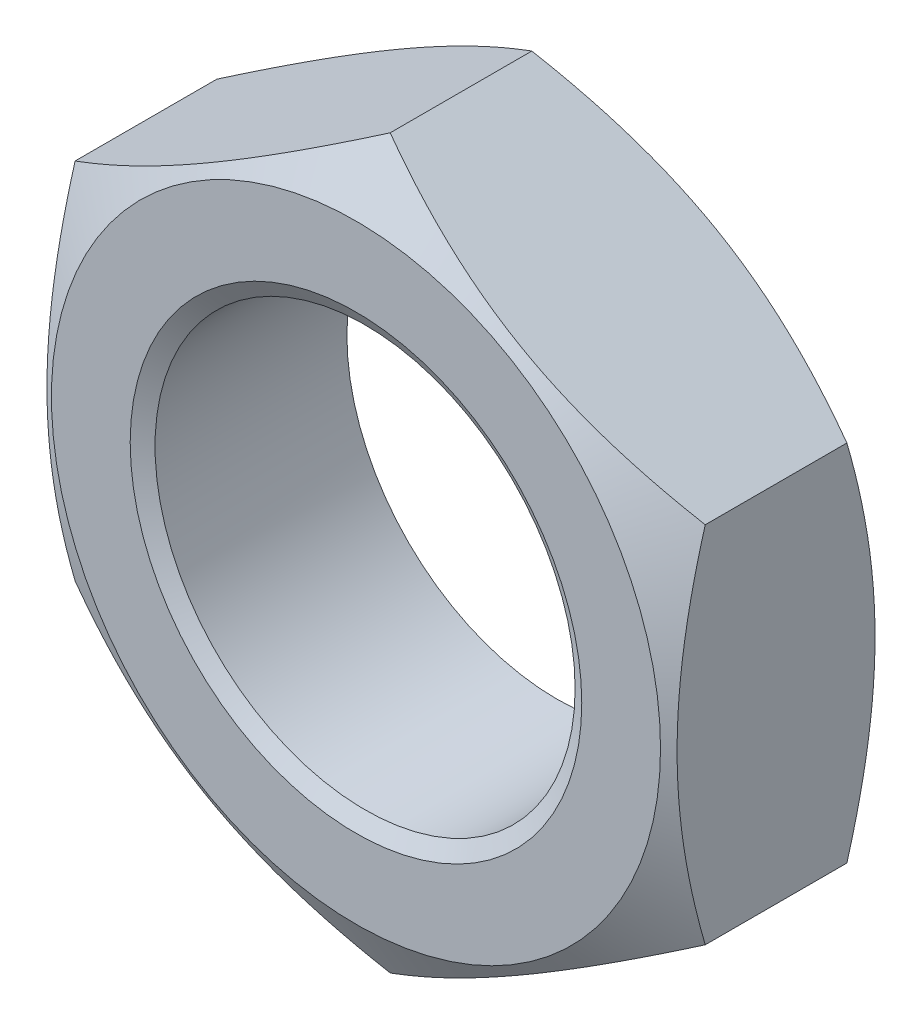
ISO-10303-21;
HEADER;
FILE_DESCRIPTION(('STEP AP214'),'2;1');
FILE_NAME('part.step','',(''),(''),'','','');
FILE_SCHEMA(('AUTOMOTIVE_DESIGN { 1 0 10303 214 1 1 1 1 }'));
ENDSEC;
DATA;
#1=APPLICATION_CONTEXT('core data for automotive mechanical design processes');
#2=APPLICATION_PROTOCOL_DEFINITION('international standard','automotive_design',2000,#1);
#3=PRODUCT_CONTEXT('',#1,'mechanical');
#4=PRODUCT('Part','Part','',(#3));
#5=PRODUCT_RELATED_PRODUCT_CATEGORY('part','',(#4));
#6=PRODUCT_DEFINITION_FORMATION('','',#4);
#7=PRODUCT_DEFINITION_CONTEXT('part definition',#1,'design');
#8=PRODUCT_DEFINITION('design','',#6,#7);
#9=PRODUCT_DEFINITION_SHAPE('','',#8);
#10=(LENGTH_UNIT() NAMED_UNIT(*) SI_UNIT(.MILLI.,.METRE.));
#11=(NAMED_UNIT(*) PLANE_ANGLE_UNIT() SI_UNIT($,.RADIAN.));
#12=(NAMED_UNIT(*) SI_UNIT($,.STERADIAN.) SOLID_ANGLE_UNIT());
#13=UNCERTAINTY_MEASURE_WITH_UNIT(LENGTH_MEASURE(1.E-05),#10,'distance_accuracy_value','');
#14=(GEOMETRIC_REPRESENTATION_CONTEXT(3) GLOBAL_UNCERTAINTY_ASSIGNED_CONTEXT((#13)) GLOBAL_UNIT_ASSIGNED_CONTEXT((#10,
#11,#12)) REPRESENTATION_CONTEXT('',''));
#15=CARTESIAN_POINT('',(0.,0.,0.));
#16=DIRECTION('',(0.,0.,1.));
#17=DIRECTION('',(1.,0.,0.));
#18=AXIS2_PLACEMENT_3D('',#15,#16,#17);
#19=CARTESIAN_POINT('',(0.,17.3205080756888,10.));
#20=DIRECTION('',(0.,0.,1.));
#21=DIRECTION('',(1.,0.,0.));
#22=AXIS2_PLACEMENT_3D('',#19,#20,#21);
#23=PLANE('',#22);
#24=CARTESIAN_POINT('',(0.,0.,10.));
#25=DIRECTION('',(0.,0.,1.));
#26=DIRECTION('',(1.,0.,0.));
#27=AXIS2_PLACEMENT_3D('',#24,#25,#26);
#28=CIRCLE('',#27,14.5);
#29=CARTESIAN_POINT('',(14.5,0.,10.));
#30=VERTEX_POINT('',#29);
#31=EDGE_CURVE('E115',#30,#30,#28,.T.);
#32=ORIENTED_EDGE('',*,*,#31,.T.);
#33=EDGE_LOOP('',(#32));
#34=FACE_BOUND('',#33,.T.);
#35=CARTESIAN_POINT('',(0.,0.,10.));
#36=DIRECTION('',(0.,0.,-1.));
#37=DIRECTION('',(-1.,0.,0.));
#38=AXIS2_PLACEMENT_3D('',#35,#36,#37);
#39=CIRCLE('',#38,10.75);
#40=CARTESIAN_POINT('',(-10.75,0.,10.));
#41=VERTEX_POINT('',#40);
#42=EDGE_CURVE('E327',#41,#41,#39,.T.);
#43=ORIENTED_EDGE('',*,*,#42,.T.);
#44=EDGE_LOOP('',(#43));
#45=FACE_BOUND('',#44,.T.);
#46=ADVANCED_FACE('F14',(#34,#45),#23,.T.);
#47=CARTESIAN_POINT('',(15.,8.66025403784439,10.));
#48=DIRECTION('',(-0.5,-0.866025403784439,0.));
#49=DIRECTION('',(0.866025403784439,-0.5,0.));
#50=AXIS2_PLACEMENT_3D('',#47,#48,#49);
#51=PLANE('',#50);
#52=CARTESIAN_POINT('',(-2.01686435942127,18.4849452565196,2.36404626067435));
#53=CARTESIAN_POINT('',(-1.64806315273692,18.2720177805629,2.21877729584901));
#54=CARTESIAN_POINT('',(-1.27778435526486,18.0582372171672,2.07835415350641));
#55=CARTESIAN_POINT('',(-0.533973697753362,17.6287979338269,1.80894242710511));
#56=CARTESIAN_POINT('',(-0.160440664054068,17.4131385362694,1.67995817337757));
#57=CARTESIAN_POINT('',(0.591460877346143,16.9790279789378,1.43476990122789));
#58=CARTESIAN_POINT('',(0.969843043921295,16.7605689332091,1.31862134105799));
#59=CARTESIAN_POINT('',(1.72989706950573,16.3217515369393,1.10180197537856));
#60=CARTESIAN_POINT('',(2.11156857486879,16.1013933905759,1.00112952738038));
#61=CARTESIAN_POINT('',(2.86621796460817,15.6656963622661,0.820250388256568));
#62=CARTESIAN_POINT('',(3.23909854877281,15.4504136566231,0.73950598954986));
#63=CARTESIAN_POINT('',(3.98753422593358,15.0183041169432,0.596486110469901));
#64=CARTESIAN_POINT('',(4.36308935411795,14.8014772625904,0.534210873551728));
#65=CARTESIAN_POINT('',(5.11559143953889,14.3670199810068,0.429942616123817));
#66=CARTESIAN_POINT('',(5.49253433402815,14.1493918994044,0.387910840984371));
#67=CARTESIAN_POINT('',(6.24775454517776,13.7133653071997,0.325235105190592));
#68=CARTESIAN_POINT('',(6.62603181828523,13.4949668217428,0.304590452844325));
#69=CARTESIAN_POINT('',(7.36041204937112,13.0709721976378,0.285928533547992));
#70=CARTESIAN_POINT('',(7.7164908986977,12.8653899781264,0.286634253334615));
#71=CARTESIAN_POINT('',(8.42821777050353,12.4544742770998,0.307519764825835));
#72=CARTESIAN_POINT('',(8.78386579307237,12.2491407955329,0.327699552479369));
#73=CARTESIAN_POINT('',(9.49454258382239,11.8388313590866,0.387002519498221));
#74=CARTESIAN_POINT('',(9.84956942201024,11.6338565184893,0.426156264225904));
#75=CARTESIAN_POINT('',(10.5577808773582,11.224970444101,0.522359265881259));
#76=CARTESIAN_POINT('',(10.9109655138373,11.0210591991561,0.57940833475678));
#77=CARTESIAN_POINT('',(11.6254284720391,10.6085638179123,0.711933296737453));
#78=CARTESIAN_POINT('',(11.9866375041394,10.4000196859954,0.787903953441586));
#79=CARTESIAN_POINT('',(12.7063665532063,9.98448392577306,0.955622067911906));
#80=CARTESIAN_POINT('',(13.064885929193,9.77749266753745,1.04737316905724));
#81=CARTESIAN_POINT('',(13.7779053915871,9.36583068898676,1.24454431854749));
#82=CARTESIAN_POINT('',(14.1324144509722,9.16115478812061,1.34992143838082));
#83=CARTESIAN_POINT('',(14.838373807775,8.75356896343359,1.57282949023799));
#84=CARTESIAN_POINT('',(15.1898255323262,8.5506582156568,1.6903543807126));
#85=CARTESIAN_POINT('',(15.5398459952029,8.34857380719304,1.81314001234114));
#86=B_SPLINE_CURVE_WITH_KNOTS('',3,(#52,#53,#54,#55,#56,#57,#58,#59,#60,#61,#62,#63,#64,#65,#66,
#67,#68,#69,#70,#71,#72,#73,#74,#75,#76,#77,#78,#79,#80,#81,#82,#83,#84,#85),.UNSPECIFIED.,.F.,
.F.,(4,2,2,2,2,2,2,2,2,2,2,2,2,2,2,2,4),(0.,1.34989753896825,2.70030393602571,4.05633390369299,
5.41221985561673,6.72607188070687,8.03994122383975,9.35128516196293,10.6625866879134,
11.8956205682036,13.1286541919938,14.3636807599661,15.5986943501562,16.8702080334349,
18.1420156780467,19.4099099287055,20.6771766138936),.UNSPECIFIED.);
#87=CARTESIAN_POINT('',(0.,17.3205080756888,1.62842109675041));
#88=VERTEX_POINT('',#87);
#89=CARTESIAN_POINT('',(15.,8.66025403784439,1.62842109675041));
#90=VERTEX_POINT('',#89);
#91=EDGE_CURVE('E31',#88,#90,#86,.T.);
#92=ORIENTED_EDGE('',*,*,#91,.F.);
#93=DIRECTION('',(0.,0.,-1.));
#94=VECTOR('',#93,1.);
#95=CARTESIAN_POINT('',(0.,17.3205080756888,10.));
#96=LINE('',#95,#94);
#97=CARTESIAN_POINT('',(0.,17.3205080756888,8.37157890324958));
#98=VERTEX_POINT('',#97);
#99=EDGE_CURVE('E9',#98,#88,#96,.T.);
#100=ORIENTED_EDGE('',*,*,#99,.F.);
#101=CARTESIAN_POINT('',(15.5398459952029,8.34857380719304,8.18685998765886));
#102=CARTESIAN_POINT('',(15.1898255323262,8.5506582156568,8.30964561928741));
#103=CARTESIAN_POINT('',(14.838373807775,8.75356896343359,8.42717050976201));
#104=CARTESIAN_POINT('',(14.1324144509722,9.16115478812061,8.65007856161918));
#105=CARTESIAN_POINT('',(13.7779053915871,9.36583068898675,8.75545568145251));
#106=CARTESIAN_POINT('',(13.064885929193,9.77749266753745,8.95262683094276));
#107=CARTESIAN_POINT('',(12.7063665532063,9.98448392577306,9.04437793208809));
#108=CARTESIAN_POINT('',(11.9866375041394,10.4000196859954,9.21209604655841));
#109=CARTESIAN_POINT('',(11.6254284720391,10.6085638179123,9.28806670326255));
#110=CARTESIAN_POINT('',(10.9109655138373,11.0210591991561,9.42059166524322));
#111=CARTESIAN_POINT('',(10.5577808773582,11.224970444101,9.47764073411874));
#112=CARTESIAN_POINT('',(9.84956942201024,11.6338565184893,9.57384373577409));
#113=CARTESIAN_POINT('',(9.49454258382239,11.8388313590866,9.61299748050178));
#114=CARTESIAN_POINT('',(8.78386579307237,12.2491407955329,9.67230044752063));
#115=CARTESIAN_POINT('',(8.42821777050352,12.4544742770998,9.69248023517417));
#116=CARTESIAN_POINT('',(7.7164908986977,12.8653899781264,9.71336574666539));
#117=CARTESIAN_POINT('',(7.36041204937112,13.0709721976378,9.714071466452));
#118=CARTESIAN_POINT('',(6.62603181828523,13.4949668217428,9.69540954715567));
#119=CARTESIAN_POINT('',(6.24775454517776,13.7133653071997,9.67476489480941));
#120=CARTESIAN_POINT('',(5.49253433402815,14.1493918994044,9.61208915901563));
#121=CARTESIAN_POINT('',(5.11559143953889,14.3670199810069,9.57005738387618));
#122=CARTESIAN_POINT('',(4.36308935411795,14.8014772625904,9.46578912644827));
#123=CARTESIAN_POINT('',(3.98753422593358,15.0183041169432,9.4035138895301));
#124=CARTESIAN_POINT('',(3.23909854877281,15.4504136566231,9.26049401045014));
#125=CARTESIAN_POINT('',(2.86621796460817,15.6656963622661,9.17974961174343));
#126=CARTESIAN_POINT('',(2.11156857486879,16.1013933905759,8.99887047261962));
#127=CARTESIAN_POINT('',(1.72989706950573,16.3217515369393,8.89819802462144));
#128=CARTESIAN_POINT('',(0.969843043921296,16.7605689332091,8.68137865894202));
#129=CARTESIAN_POINT('',(0.591460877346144,16.9790279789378,8.56523009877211));
#130=CARTESIAN_POINT('',(-0.160440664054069,17.4131385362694,8.32004182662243));
#131=CARTESIAN_POINT('',(-0.533973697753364,17.6287979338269,8.19105757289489));
#132=CARTESIAN_POINT('',(-1.27778435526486,18.0582372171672,7.92164584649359));
#133=CARTESIAN_POINT('',(-1.64806315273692,18.2720177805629,7.78122270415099));
#134=CARTESIAN_POINT('',(-2.01686435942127,18.4849452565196,7.63595373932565));
#135=B_SPLINE_CURVE_WITH_KNOTS('',3,(#101,#102,#103,#104,#105,#106,#107,#108,#109,#110,#111,
#112,#113,#114,#115,#116,#117,#118,#119,#120,#121,#122,#123,#124,#125,#126,#127,#128,#129,#130,
#131,#132,#133,#134),.UNSPECIFIED.,.F.,.F.,(4,2,2,2,2,2,2,2,2,2,2,2,2,2,2,2,4),(0.,
1.26726668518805,2.53516093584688,3.80696858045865,5.07848226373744,6.31349585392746,
7.5485224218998,8.78155604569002,10.0145899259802,11.3258914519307,12.6372353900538,
13.9511047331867,15.2649567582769,16.6208427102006,17.9768726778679,19.3272790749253,
20.6771766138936),.UNSPECIFIED.);
#136=CARTESIAN_POINT('',(15.,8.66025403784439,8.37157890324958));
#137=VERTEX_POINT('',#136);
#138=EDGE_CURVE('E92',#137,#98,#135,.T.);
#139=ORIENTED_EDGE('',*,*,#138,.F.);
#140=DIRECTION('',(0.,0.,-1.));
#141=VECTOR('',#140,1.);
#142=CARTESIAN_POINT('',(15.,8.66025403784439,10.));
#143=LINE('',#142,#141);
#144=EDGE_CURVE('E88',#137,#90,#143,.T.);
#145=ORIENTED_EDGE('',*,*,#144,.T.);
#146=EDGE_LOOP('',(#92,#100,#139,#145));
#147=FACE_BOUND('',#146,.T.);
#148=ADVANCED_FACE('F16',(#147),#51,.F.);
#149=CARTESIAN_POINT('',(0.,17.3205080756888,10.));
#150=DIRECTION('',(0.5,-0.866025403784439,0.));
#151=DIRECTION('',(0.866025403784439,0.5,0.));
#152=AXIS2_PLACEMENT_3D('',#149,#150,#151);
#153=PLANE('',#152);
#154=CARTESIAN_POINT('',(-27.9567259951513,1.17968479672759,7.78360792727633));
#155=CARTESIAN_POINT('',(-27.6585449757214,1.35183968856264,7.61580014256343));
#156=CARTESIAN_POINT('',(-27.3600071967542,1.52420055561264,7.44883798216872));
#157=CARTESIAN_POINT('',(-26.7621396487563,1.86937954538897,7.11680576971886));
#158=CARTESIAN_POINT('',(-26.4628098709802,2.04219767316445,6.95173573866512));
#159=CARTESIAN_POINT('',(-25.5634217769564,2.56145963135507,6.45961434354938));
#160=CARTESIAN_POINT('',(-24.9620670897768,2.90865192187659,6.13570946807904));
#161=CARTESIAN_POINT('',(-23.7513280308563,3.60767244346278,5.49634103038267));
#162=CARTESIAN_POINT('',(-23.1419168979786,3.95951612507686,5.1809448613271));
#163=CARTESIAN_POINT('',(-21.9180176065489,4.66613471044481,4.56362750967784));
#164=CARTESIAN_POINT('',(-21.3035297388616,5.02090944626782,4.26170556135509));
#165=CARTESIAN_POINT('',(-20.0606068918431,5.73851128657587,3.67142004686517));
#166=CARTESIAN_POINT('',(-19.4320937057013,6.1013835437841,3.38327484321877));
#167=CARTESIAN_POINT('',(-18.1673821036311,6.83156512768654,2.8299153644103));
#168=CARTESIAN_POINT('',(-17.5311826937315,7.1988750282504,2.56470409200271));
#169=CARTESIAN_POINT('',(-16.2514978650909,7.93770140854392,2.06490465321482));
#170=CARTESIAN_POINT('',(-15.6080343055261,8.30920526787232,1.8302425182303));
#171=CARTESIAN_POINT('',(-14.3114560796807,9.0577850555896,1.39981722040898));
#172=CARTESIAN_POINT('',(-13.6583450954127,9.43485885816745,1.20403960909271));
#173=CARTESIAN_POINT('',(-12.687282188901,9.99550228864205,0.951625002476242));
#174=CARTESIAN_POINT('',(-12.3730361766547,10.1769323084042,0.875834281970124));
#175=CARTESIAN_POINT('',(-11.7424785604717,10.540984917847,0.736662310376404));
#176=CARTESIAN_POINT('',(-11.4261670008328,10.7236074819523,0.673280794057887));
#177=CARTESIAN_POINT('',(-10.7916974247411,11.0899186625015,0.560059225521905));
#178=CARTESIAN_POINT('',(-10.4735392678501,11.2736073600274,0.51022021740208));
#179=CARTESIAN_POINT('',(-9.83575587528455,11.6418317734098,0.425091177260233));
#180=CARTESIAN_POINT('',(-9.51613063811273,11.8263674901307,0.389801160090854));
#181=CARTESIAN_POINT('',(-8.87796339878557,12.1948135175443,0.334723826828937));
#182=CARTESIAN_POINT('',(-8.55942786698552,12.3787200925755,0.314837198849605));
#183=CARTESIAN_POINT('',(-7.92191526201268,12.7467881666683,0.29064410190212));
#184=CARTESIAN_POINT('',(-7.60293819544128,12.9309496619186,0.286337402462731));
#185=CARTESIAN_POINT('',(-6.96519755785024,13.299149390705,0.293405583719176));
#186=CARTESIAN_POINT('',(-6.64643395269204,13.4831876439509,0.304776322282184));
#187=CARTESIAN_POINT('',(-6.0095976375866,13.8508652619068,0.342921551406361));
#188=CARTESIAN_POINT('',(-5.69152495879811,14.0345046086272,0.369696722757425));
#189=CARTESIAN_POINT('',(-4.91661491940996,14.4818991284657,0.453141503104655));
#190=CARTESIAN_POINT('',(-4.46040945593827,14.7452894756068,0.517785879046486));
#191=CARTESIAN_POINT('',(-3.55166052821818,15.2699559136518,0.675130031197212));
#192=CARTESIAN_POINT('',(-3.09911763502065,15.5312316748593,0.767834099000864));
#193=CARTESIAN_POINT('',(-1.74615244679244,16.312366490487,1.08337588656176));
#194=CARTESIAN_POINT('',(-0.852169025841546,16.8285080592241,1.34342798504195));
#195=CARTESIAN_POINT('',(0.485139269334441,17.6006033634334,1.79064006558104));
#196=CARTESIAN_POINT('',(0.935471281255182,17.8606026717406,1.95143407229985));
#197=CARTESIAN_POINT('',(1.83178276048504,18.3780883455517,2.28873818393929));
#198=CARTESIAN_POINT('',(2.27776183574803,18.6355744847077,2.46524969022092));
#199=CARTESIAN_POINT('',(3.16314256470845,19.1467492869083,2.83025115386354));
#200=CARTESIAN_POINT('',(3.60256718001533,19.4004512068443,3.01866746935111));
#201=CARTESIAN_POINT('',(4.25895131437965,19.7794147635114,3.30929326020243));
#202=CARTESIAN_POINT('',(4.47725234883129,19.9054509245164,3.40748564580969));
#203=CARTESIAN_POINT('',(4.91301153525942,20.1570366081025,3.60632018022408));
#204=CARTESIAN_POINT('',(5.13046970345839,20.2825861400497,3.70696228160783));
#205=CARTESIAN_POINT('',(5.34753600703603,20.4079094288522,3.80871814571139));
#206=B_SPLINE_CURVE_WITH_KNOTS('',3,(#154,#155,#156,#157,#158,#159,#160,#161,#162,#163,#164,
#165,#166,#167,#168,#169,#170,#171,#172,#173,#174,#175,#176,#177,#178,#179,#180,#181,#182,#183,
#184,#185,#186,#187,#188,#189,#190,#191,#192,#193,#194,#195,#196,#197,#198,#199,#200,#201,#202,
#203,#204,#205),.UNSPECIFIED.,.F.,.F.,(4,2,2,2,2,2,2,2,2,2,2,2,2,2,2,2,2,2,2,2,2,2,2,2,2,4),(0.,
1.14907491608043,2.29816257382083,4.59673265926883,6.91003214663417,9.22320000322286,
11.5654693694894,13.9080449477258,16.2448385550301,18.5807622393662,19.6926575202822,
20.8045290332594,21.9164862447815,23.0284445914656,24.1331725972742,25.2378842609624,
26.3423041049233,27.4467727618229,29.0380629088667,30.6295965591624,33.8188203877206,
35.4515711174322,37.0844675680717,38.7080997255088,39.5196548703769,40.3311943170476),.UNSPECIFIED.);
#207=CARTESIAN_POINT('',(-15.,8.66025403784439,1.62842109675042));
#208=VERTEX_POINT('',#207);
#209=EDGE_CURVE('E113',#208,#88,#206,.T.);
#210=ORIENTED_EDGE('',*,*,#209,.F.);
#211=DIRECTION('',(0.,0.,-1.));
#212=VECTOR('',#211,1.);
#213=CARTESIAN_POINT('',(-15.,8.66025403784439,10.));
#214=LINE('',#213,#212);
#215=CARTESIAN_POINT('',(-15.,8.66025403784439,8.37157890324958));
#216=VERTEX_POINT('',#215);
#217=EDGE_CURVE('E24',#216,#208,#214,.T.);
#218=ORIENTED_EDGE('',*,*,#217,.F.);
#219=CARTESIAN_POINT('',(-27.9567259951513,1.17968479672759,2.21639207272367));
#220=CARTESIAN_POINT('',(-27.6585449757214,1.35183968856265,2.38419985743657));
#221=CARTESIAN_POINT('',(-27.3600071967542,1.52420055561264,2.55116201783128));
#222=CARTESIAN_POINT('',(-26.7621396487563,1.86937954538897,2.88319423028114));
#223=CARTESIAN_POINT('',(-26.4628098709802,2.04219767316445,3.04826426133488));
#224=CARTESIAN_POINT('',(-25.5634217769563,2.56145963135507,3.54038565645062));
#225=CARTESIAN_POINT('',(-24.9620670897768,2.9086519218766,3.86429053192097));
#226=CARTESIAN_POINT('',(-23.7513280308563,3.60767244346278,4.50365896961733));
#227=CARTESIAN_POINT('',(-23.1419168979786,3.95951612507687,4.8190551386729));
#228=CARTESIAN_POINT('',(-21.9180176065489,4.66613471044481,5.43637249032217));
#229=CARTESIAN_POINT('',(-21.3035297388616,5.02090944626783,5.73829443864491));
#230=CARTESIAN_POINT('',(-20.0606068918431,5.73851128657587,6.32857995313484));
#231=CARTESIAN_POINT('',(-19.4320937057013,6.1013835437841,6.61672515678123));
#232=CARTESIAN_POINT('',(-18.1673821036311,6.83156512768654,7.1700846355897));
#233=CARTESIAN_POINT('',(-17.5311826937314,7.1988750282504,7.4352959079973));
#234=CARTESIAN_POINT('',(-16.2514978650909,7.93770140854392,7.93509534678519));
#235=CARTESIAN_POINT('',(-15.6080343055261,8.30920526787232,8.1697574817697));
#236=CARTESIAN_POINT('',(-14.3114560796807,9.0577850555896,8.60018277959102));
#237=CARTESIAN_POINT('',(-13.6583450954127,9.43485885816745,8.79596039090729));
#238=CARTESIAN_POINT('',(-12.687282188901,9.99550228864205,9.04837499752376));
#239=CARTESIAN_POINT('',(-12.3730361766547,10.1769323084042,9.12416571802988));
#240=CARTESIAN_POINT('',(-11.7424785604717,10.540984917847,9.2633376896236));
#241=CARTESIAN_POINT('',(-11.4261670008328,10.7236074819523,9.32671920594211));
#242=CARTESIAN_POINT('',(-10.7916974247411,11.0899186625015,9.4399407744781));
#243=CARTESIAN_POINT('',(-10.4735392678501,11.2736073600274,9.48977978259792));
#244=CARTESIAN_POINT('',(-9.83575587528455,11.6418317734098,9.57490882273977));
#245=CARTESIAN_POINT('',(-9.51613063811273,11.8263674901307,9.61019883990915));
#246=CARTESIAN_POINT('',(-8.87796339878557,12.1948135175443,9.66527617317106));
#247=CARTESIAN_POINT('',(-8.55942786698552,12.3787200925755,9.68516280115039));
#248=CARTESIAN_POINT('',(-7.92191526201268,12.7467881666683,9.70935589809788));
#249=CARTESIAN_POINT('',(-7.60293819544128,12.9309496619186,9.71366259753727));
#250=CARTESIAN_POINT('',(-6.96519755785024,13.299149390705,9.70659441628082));
#251=CARTESIAN_POINT('',(-6.64643395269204,13.4831876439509,9.69522367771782));
#252=CARTESIAN_POINT('',(-6.0095976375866,13.8508652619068,9.65707844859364));
#253=CARTESIAN_POINT('',(-5.69152495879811,14.0345046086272,9.63030327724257));
#254=CARTESIAN_POINT('',(-4.91661491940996,14.4818991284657,9.54685849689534));
#255=CARTESIAN_POINT('',(-4.46040945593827,14.7452894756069,9.48221412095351));
#256=CARTESIAN_POINT('',(-3.55166052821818,15.2699559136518,9.32486996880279));
#257=CARTESIAN_POINT('',(-3.09911763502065,15.5312316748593,9.23216590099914));
#258=CARTESIAN_POINT('',(-1.74615244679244,16.312366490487,8.91662411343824));
#259=CARTESIAN_POINT('',(-0.852169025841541,16.8285080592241,8.65657201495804));
#260=CARTESIAN_POINT('',(0.485139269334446,17.6006033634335,8.20935993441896));
#261=CARTESIAN_POINT('',(0.935471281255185,17.8606026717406,8.04856592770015));
#262=CARTESIAN_POINT('',(1.83178276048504,18.3780883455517,7.71126181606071));
#263=CARTESIAN_POINT('',(2.27776183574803,18.6355744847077,7.53475030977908));
#264=CARTESIAN_POINT('',(3.16314256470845,19.1467492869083,7.16974884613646));
#265=CARTESIAN_POINT('',(3.60256718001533,19.4004512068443,6.98133253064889));
#266=CARTESIAN_POINT('',(4.25895131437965,19.7794147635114,6.69070673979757));
#267=CARTESIAN_POINT('',(4.47725234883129,19.9054509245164,6.59251435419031));
#268=CARTESIAN_POINT('',(4.91301153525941,20.1570366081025,6.39367981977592));
#269=CARTESIAN_POINT('',(5.13046970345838,20.2825861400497,6.29303771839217));
#270=CARTESIAN_POINT('',(5.34753600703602,20.4079094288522,6.19128185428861));
#271=B_SPLINE_CURVE_WITH_KNOTS('',3,(#219,#220,#221,#222,#223,#224,#225,#226,#227,#228,#229,
#230,#231,#232,#233,#234,#235,#236,#237,#238,#239,#240,#241,#242,#243,#244,#245,#246,#247,#248,
#249,#250,#251,#252,#253,#254,#255,#256,#257,#258,#259,#260,#261,#262,#263,#264,#265,#266,#267,
#268,#269,#270),.UNSPECIFIED.,.F.,.F.,(4,2,2,2,2,2,2,2,2,2,2,2,2,2,2,2,2,2,2,2,2,2,2,2,2,4),(0.,
1.14907491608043,2.29816257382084,4.59673265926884,6.91003214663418,9.22320000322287,
11.5654693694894,13.9080449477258,16.2448385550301,18.5807622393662,19.6926575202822,
20.8045290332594,21.9164862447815,23.0284445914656,24.1331725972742,25.2378842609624,
26.3423041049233,27.4467727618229,29.0380629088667,30.6295965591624,33.8188203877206,
35.4515711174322,37.0844675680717,38.7080997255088,39.5196548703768,40.3311943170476),.UNSPECIFIED.);
#272=EDGE_CURVE('E111',#98,#216,#271,.F.);
#273=ORIENTED_EDGE('',*,*,#272,.F.);
#274=ORIENTED_EDGE('',*,*,#99,.T.);
#275=EDGE_LOOP('',(#210,#218,#273,#274));
#276=FACE_BOUND('',#275,.T.);
#277=ADVANCED_FACE('F110',(#276),#153,.F.);
#278=CARTESIAN_POINT('',(-15.,8.66025403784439,10.));
#279=DIRECTION('',(1.,0.,0.));
#280=DIRECTION('',(0.,1.,0.));
#281=AXIS2_PLACEMENT_3D('',#278,#279,#280);
#282=PLANE('',#281);
#283=CARTESIAN_POINT('',(-15.,-23.5394233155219,7.7436773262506));
#284=CARTESIAN_POINT('',(-15.,-23.2106725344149,7.58361255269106));
#285=CARTESIAN_POINT('',(-15.,-22.8815433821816,7.42432526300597));
#286=CARTESIAN_POINT('',(-15.,-22.222449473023,7.10748120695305));
#287=CARTESIAN_POINT('',(-15.,-21.8924847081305,6.94992445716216));
#288=CARTESIAN_POINT('',(-15.,-20.9011345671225,6.48007357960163));
#289=CARTESIAN_POINT('',(-15.,-20.238386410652,6.1706442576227));
#290=CARTESIAN_POINT('',(-15.,-18.9050706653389,5.55963717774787));
#291=CARTESIAN_POINT('',(-15.,-18.2344803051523,5.25810899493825));
#292=CARTESIAN_POINT('',(-15.,-16.888062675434,4.66702289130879));
#293=CARTESIAN_POINT('',(-15.,-16.2122356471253,4.37746442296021));
#294=CARTESIAN_POINT('',(-15.,-14.8314209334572,3.80398642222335));
#295=CARTESIAN_POINT('',(-15.,-14.1262172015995,3.52058444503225));
#296=CARTESIAN_POINT('',(-15.,-12.7076573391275,2.97456536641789));
#297=CARTESIAN_POINT('',(-15.,-11.9943003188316,2.71195055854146));
#298=CARTESIAN_POINT('',(-15.,-10.5595695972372,2.21420209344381));
#299=CARTESIAN_POINT('',(-15.,-9.83821454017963,1.97901511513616));
#300=CARTESIAN_POINT('',(-15.,-8.38509302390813,1.54347073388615));
#301=CARTESIAN_POINT('',(-15.,-7.65332983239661,1.34310264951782));
#302=CARTESIAN_POINT('',(-15.,-6.54976630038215,1.07632784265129));
#303=CARTESIAN_POINT('',(-15.,-6.18198027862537,0.993221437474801));
#304=CARTESIAN_POINT('',(-15.,-5.44384520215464,0.839230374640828));
#305=CARTESIAN_POINT('',(-15.,-5.07349619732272,0.768345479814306));
#306=CARTESIAN_POINT('',(-15.,-4.33046993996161,0.640030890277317));
#307=CARTESIAN_POINT('',(-15.,-3.95779273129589,0.582600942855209));
#308=CARTESIAN_POINT('',(-15.,-3.21048393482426,0.482331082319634));
#309=CARTESIAN_POINT('',(-15.,-2.83585243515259,0.439490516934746));
#310=CARTESIAN_POINT('',(-15.,-2.09016828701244,0.369803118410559));
#311=CARTESIAN_POINT('',(-15.,-1.71913510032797,0.342749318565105));
#312=CARTESIAN_POINT('',(-15.,-0.976256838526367,0.304369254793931));
#313=CARTESIAN_POINT('',(-15.,-0.604411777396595,0.293042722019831));
#314=CARTESIAN_POINT('',(-15.,0.139424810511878,0.286387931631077));
#315=CARTESIAN_POINT('',(-15.,0.511416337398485,0.291059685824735));
#316=CARTESIAN_POINT('',(-15.,1.25486519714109,0.316284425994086));
#317=CARTESIAN_POINT('',(-15.,1.62632250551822,0.336838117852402));
#318=CARTESIAN_POINT('',(-15.,2.51076437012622,0.404241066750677));
#319=CARTESIAN_POINT('',(-15.,3.02321985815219,0.458164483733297));
#320=CARTESIAN_POINT('',(-15.,4.04451129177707,0.593366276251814));
#321=CARTESIAN_POINT('',(-15.,4.55334676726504,0.674648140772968));
#322=CARTESIAN_POINT('',(-15.,5.56684892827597,0.861675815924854));
#323=CARTESIAN_POINT('',(-15.,6.07151223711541,0.967439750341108));
#324=CARTESIAN_POINT('',(-15.,7.07586820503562,1.2001895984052));
#325=CARTESIAN_POINT('',(-15.,7.57556092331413,1.3271752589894));
#326=CARTESIAN_POINT('',(-15.,8.58123059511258,1.60233673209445));
#327=CARTESIAN_POINT('',(-15.,9.08709315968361,1.75092770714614));
#328=CARTESIAN_POINT('',(-15.,10.0938393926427,2.06402864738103));
#329=CARTESIAN_POINT('',(-15.,10.5947230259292,2.22853872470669));
#330=CARTESIAN_POINT('',(-15.,11.5917504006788,2.57081650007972));
#331=CARTESIAN_POINT('',(-15.,12.0878955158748,2.748580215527));
#332=CARTESIAN_POINT('',(-15.,13.0760359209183,3.11521846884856));
#333=CARTESIAN_POINT('',(-15.,13.5680312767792,3.3040928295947));
#334=CARTESIAN_POINT('',(-15.,14.7927645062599,3.78761571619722));
#335=CARTESIAN_POINT('',(-15.,15.5232172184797,4.08804593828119));
#336=CARTESIAN_POINT('',(-15.,16.9773370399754,4.70495380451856));
#337=CARTESIAN_POINT('',(-15.,17.7010035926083,5.02143275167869));
#338=CARTESIAN_POINT('',(-15.,19.142928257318,5.66699290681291));
#339=CARTESIAN_POINT('',(-15.,19.8611847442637,5.99607773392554));
#340=CARTESIAN_POINT('',(-15.,21.2930546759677,6.66411700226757));
#341=CARTESIAN_POINT('',(-15.,22.0066682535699,7.0030711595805));
#342=CARTESIAN_POINT('',(-15.,23.4310196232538,7.68933199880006));
#343=CARTESIAN_POINT('',(-15.,24.1417523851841,8.03664910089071));
#344=CARTESIAN_POINT('',(-15.,25.5600483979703,8.73769598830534));
#345=CARTESIAN_POINT('',(-15.,26.2676116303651,9.09142581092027));
#346=CARTESIAN_POINT('',(-15.,27.6799721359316,9.80407420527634));
#347=CARTESIAN_POINT('',(-15.,28.3847698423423,10.1629919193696));
#348=CARTESIAN_POINT('',(-15.,29.7921315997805,10.8851714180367));
#349=CARTESIAN_POINT('',(-15.,30.494695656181,11.2484331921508));
#350=CARTESIAN_POINT('',(-15.,32.4694194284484,12.2759205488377));
#351=CARTESIAN_POINT('',(-15.,33.7394237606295,12.9442881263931));
#352=CARTESIAN_POINT('',(-15.,36.2748342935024,14.2898070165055));
#353=CARTESIAN_POINT('',(-15.,37.5402402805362,14.9669587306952));
#354=CARTESIAN_POINT('',(-15.,40.0638041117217,16.3259383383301));
#355=CARTESIAN_POINT('',(-15.,41.3219723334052,17.0077469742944));
#356=CARTESIAN_POINT('',(-15.,43.2070864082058,18.0342851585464));
#357=CARTESIAN_POINT('',(-15.,43.8350813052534,18.3770910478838));
#358=CARTESIAN_POINT('',(-15.,45.0904436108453,19.0638477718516));
#359=CARTESIAN_POINT('',(-15.,45.7178110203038,19.4077986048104));
#360=CARTESIAN_POINT('',(-15.,46.3449014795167,19.7522537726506));
#361=B_SPLINE_CURVE_WITH_KNOTS('',3,(#283,#284,#285,#286,#287,#288,#289,#290,#291,#292,#293,
#294,#295,#296,#297,#298,#299,#300,#301,#302,#303,#304,#305,#306,#307,#308,#309,#310,#311,#312,
#313,#314,#315,#316,#317,#318,#319,#320,#321,#322,#323,#324,#325,#326,#327,#328,#329,#330,#331,
#332,#333,#334,#335,#336,#337,#338,#339,#340,#341,#342,#343,#344,#345,#346,#347,#348,#349,#350,
#351,#352,#353,#354,#355,#356,#357,#358,#359,#360),.UNSPECIFIED.,.F.,.F.,(4,2,2,2,2,2,2,2,2,2,2,
2,2,2,2,2,2,2,2,2,2,2,2,2,2,2,2,2,2,2,2,2,2,2,2,2,2,2,4),(0.,1.09693942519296,2.1938893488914,
4.38809987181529,6.59379553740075,8.79939019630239,11.0791970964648,13.3592551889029,
15.6348041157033,17.9096537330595,19.040659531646,20.1716433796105,21.3026059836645,
22.4335180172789,23.5492496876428,24.6649622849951,25.7806757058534,26.8964387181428,
28.4414443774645,29.9866471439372,31.5329974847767,33.0793293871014,34.660720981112,
36.2421237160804,37.8230531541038,39.403957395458,41.7731534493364,44.1425421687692,
46.5126163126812,48.8826223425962,51.2557521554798,53.6288957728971,56.0016514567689,
58.374401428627,62.6797680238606,66.9853321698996,71.2784093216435,73.42481037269,
75.5712082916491),.UNSPECIFIED.);
#362=CARTESIAN_POINT('',(-15.,-8.66025403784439,1.62842109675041));
#363=VERTEX_POINT('',#362);
#364=EDGE_CURVE('E105',#363,#208,#361,.T.);
#365=ORIENTED_EDGE('',*,*,#364,.F.);
#366=DIRECTION('',(0.,0.,-1.));
#367=VECTOR('',#366,1.);
#368=CARTESIAN_POINT('',(-15.,-8.66025403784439,10.));
#369=LINE('',#368,#367);
#370=CARTESIAN_POINT('',(-15.,-8.66025403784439,8.37157890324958));
#371=VERTEX_POINT('',#370);
#372=EDGE_CURVE('E90',#371,#363,#369,.T.);
#373=ORIENTED_EDGE('',*,*,#372,.F.);
#374=CARTESIAN_POINT('',(-15.,-23.5394233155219,2.2563226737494));
#375=CARTESIAN_POINT('',(-15.,-23.2106725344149,2.41638744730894));
#376=CARTESIAN_POINT('',(-15.,-22.8815433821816,2.57567473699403));
#377=CARTESIAN_POINT('',(-15.,-22.222449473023,2.89251879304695));
#378=CARTESIAN_POINT('',(-15.,-21.8924847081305,3.05007554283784));
#379=CARTESIAN_POINT('',(-15.,-20.9011345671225,3.51992642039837));
#380=CARTESIAN_POINT('',(-15.,-20.238386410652,3.8293557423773));
#381=CARTESIAN_POINT('',(-15.,-18.9050706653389,4.44036282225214));
#382=CARTESIAN_POINT('',(-15.,-18.2344803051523,4.74189100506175));
#383=CARTESIAN_POINT('',(-15.,-16.888062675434,5.33297710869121));
#384=CARTESIAN_POINT('',(-15.,-16.2122356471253,5.62253557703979));
#385=CARTESIAN_POINT('',(-15.,-14.8314209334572,6.19601357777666));
#386=CARTESIAN_POINT('',(-15.,-14.1262172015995,6.47941555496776));
#387=CARTESIAN_POINT('',(-15.,-12.7076573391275,7.02543463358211));
#388=CARTESIAN_POINT('',(-15.,-11.9943003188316,7.28804944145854));
#389=CARTESIAN_POINT('',(-15.,-10.5595695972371,7.78579790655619));
#390=CARTESIAN_POINT('',(-15.,-9.83821454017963,8.02098488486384));
#391=CARTESIAN_POINT('',(-15.,-8.38509302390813,8.45652926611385));
#392=CARTESIAN_POINT('',(-15.,-7.65332983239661,8.65689735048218));
#393=CARTESIAN_POINT('',(-15.,-6.54976630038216,8.92367215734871));
#394=CARTESIAN_POINT('',(-15.,-6.18198027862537,9.0067785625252));
#395=CARTESIAN_POINT('',(-15.,-5.44384520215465,9.16076962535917));
#396=CARTESIAN_POINT('',(-15.,-5.07349619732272,9.23165452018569));
#397=CARTESIAN_POINT('',(-15.,-4.33046993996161,9.35996910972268));
#398=CARTESIAN_POINT('',(-15.,-3.95779273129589,9.41739905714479));
#399=CARTESIAN_POINT('',(-15.,-3.21048393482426,9.51766891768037));
#400=CARTESIAN_POINT('',(-15.,-2.83585243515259,9.56050948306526));
#401=CARTESIAN_POINT('',(-15.,-2.09016828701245,9.63019688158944));
#402=CARTESIAN_POINT('',(-15.,-1.71913510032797,9.6572506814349));
#403=CARTESIAN_POINT('',(-15.,-0.976256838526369,9.69563074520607));
#404=CARTESIAN_POINT('',(-15.,-0.604411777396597,9.70695727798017));
#405=CARTESIAN_POINT('',(-15.,0.139424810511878,9.71361206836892));
#406=CARTESIAN_POINT('',(-15.,0.511416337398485,9.70894031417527));
#407=CARTESIAN_POINT('',(-15.,1.25486519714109,9.68371557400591));
#408=CARTESIAN_POINT('',(-15.,1.62632250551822,9.6631618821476));
#409=CARTESIAN_POINT('',(-15.,2.51076437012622,9.59575893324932));
#410=CARTESIAN_POINT('',(-15.,3.02321985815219,9.5418355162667));
#411=CARTESIAN_POINT('',(-15.,4.04451129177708,9.40663372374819));
#412=CARTESIAN_POINT('',(-15.,4.55334676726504,9.32535185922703));
#413=CARTESIAN_POINT('',(-15.,5.56684892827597,9.13832418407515));
#414=CARTESIAN_POINT('',(-15.,6.07151223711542,9.03256024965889));
#415=CARTESIAN_POINT('',(-15.,7.07586820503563,8.7998104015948));
#416=CARTESIAN_POINT('',(-15.,7.57556092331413,8.6728247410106));
#417=CARTESIAN_POINT('',(-15.,8.58123059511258,8.39766326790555));
#418=CARTESIAN_POINT('',(-15.,9.08709315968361,8.24907229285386));
#419=CARTESIAN_POINT('',(-15.,10.0938393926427,7.93597135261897));
#420=CARTESIAN_POINT('',(-15.,10.5947230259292,7.77146127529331));
#421=CARTESIAN_POINT('',(-15.,11.5917504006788,7.42918349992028));
#422=CARTESIAN_POINT('',(-15.,12.0878955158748,7.251419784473));
#423=CARTESIAN_POINT('',(-15.,13.0760359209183,6.88478153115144));
#424=CARTESIAN_POINT('',(-15.,13.5680312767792,6.6959071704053));
#425=CARTESIAN_POINT('',(-15.,14.7927645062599,6.21238428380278));
#426=CARTESIAN_POINT('',(-15.,15.5232172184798,5.9119540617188));
#427=CARTESIAN_POINT('',(-15.,16.9773370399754,5.29504619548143));
#428=CARTESIAN_POINT('',(-15.,17.7010035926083,4.9785672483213));
#429=CARTESIAN_POINT('',(-15.,19.142928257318,4.33300709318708));
#430=CARTESIAN_POINT('',(-15.,19.8611847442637,4.00392226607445));
#431=CARTESIAN_POINT('',(-15.,21.2930546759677,3.33588299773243));
#432=CARTESIAN_POINT('',(-15.,22.0066682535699,2.99692884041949));
#433=CARTESIAN_POINT('',(-15.,23.4310196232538,2.31066800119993));
#434=CARTESIAN_POINT('',(-15.,24.1417523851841,1.96335089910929));
#435=CARTESIAN_POINT('',(-15.,25.5600483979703,1.26230401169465));
#436=CARTESIAN_POINT('',(-15.,26.2676116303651,0.908574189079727));
#437=CARTESIAN_POINT('',(-15.,27.6799721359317,0.195925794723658));
#438=CARTESIAN_POINT('',(-15.,28.3847698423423,-0.162991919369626));
#439=CARTESIAN_POINT('',(-15.,29.7921315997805,-0.885171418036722));
#440=CARTESIAN_POINT('',(-15.,30.4946956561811,-1.24843319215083));
#441=CARTESIAN_POINT('',(-15.,32.4694194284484,-2.27592054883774));
#442=CARTESIAN_POINT('',(-15.,33.7394237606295,-2.94428812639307));
#443=CARTESIAN_POINT('',(-15.,36.2748342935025,-4.28980701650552));
#444=CARTESIAN_POINT('',(-15.,37.5402402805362,-4.96695873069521));
#445=CARTESIAN_POINT('',(-15.,40.0638041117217,-6.32593833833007));
#446=CARTESIAN_POINT('',(-15.,41.3219723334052,-7.00774697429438));
#447=CARTESIAN_POINT('',(-15.,43.2070864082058,-8.03428515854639));
#448=CARTESIAN_POINT('',(-15.,43.8350813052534,-8.37709104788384));
#449=CARTESIAN_POINT('',(-15.,45.0904436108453,-9.06384777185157));
#450=CARTESIAN_POINT('',(-15.,45.7178110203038,-9.40779860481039));
#451=CARTESIAN_POINT('',(-15.,46.3449014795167,-9.75225377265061));
#452=B_SPLINE_CURVE_WITH_KNOTS('',3,(#374,#375,#376,#377,#378,#379,#380,#381,#382,#383,#384,
#385,#386,#387,#388,#389,#390,#391,#392,#393,#394,#395,#396,#397,#398,#399,#400,#401,#402,#403,
#404,#405,#406,#407,#408,#409,#410,#411,#412,#413,#414,#415,#416,#417,#418,#419,#420,#421,#422,
#423,#424,#425,#426,#427,#428,#429,#430,#431,#432,#433,#434,#435,#436,#437,#438,#439,#440,#441,
#442,#443,#444,#445,#446,#447,#448,#449,#450,#451),.UNSPECIFIED.,.F.,.F.,(4,2,2,2,2,2,2,2,2,2,2,
2,2,2,2,2,2,2,2,2,2,2,2,2,2,2,2,2,2,2,2,2,2,2,2,2,2,2,4),(0.,1.09693942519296,2.1938893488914,
4.38809987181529,6.59379553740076,8.7993901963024,11.0791970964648,13.359255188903,
15.6348041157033,17.9096537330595,19.040659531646,20.1716433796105,21.3026059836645,
22.4335180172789,23.5492496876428,24.6649622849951,25.7806757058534,26.8964387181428,
28.4414443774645,29.9866471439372,31.5329974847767,33.0793293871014,34.660720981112,
36.2421237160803,37.8230531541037,39.403957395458,41.7731534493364,44.1425421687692,
46.5126163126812,48.8826223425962,51.2557521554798,53.6288957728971,56.001651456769,
58.3744014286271,62.6797680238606,66.9853321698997,71.2784093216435,73.42481037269,
75.5712082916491),.UNSPECIFIED.);
#453=EDGE_CURVE('E106',#216,#371,#452,.F.);
#454=ORIENTED_EDGE('',*,*,#453,.F.);
#455=ORIENTED_EDGE('',*,*,#217,.T.);
#456=EDGE_LOOP('',(#365,#373,#454,#455));
#457=FACE_BOUND('',#456,.T.);
#458=ADVANCED_FACE('F103',(#457),#282,.F.);
#459=CARTESIAN_POINT('',(-15.,-8.66025403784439,10.));
#460=DIRECTION('',(0.5,0.866025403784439,0.));
#461=DIRECTION('',(-0.866025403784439,0.5,0.));
#462=AXIS2_PLACEMENT_3D('',#459,#460,#461);
#463=PLANE('',#462);
#464=CARTESIAN_POINT('',(0.519632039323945,-17.620517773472,1.80605448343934));
#465=CARTESIAN_POINT('',(0.169833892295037,-17.4185617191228,1.68356993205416));
#466=CARTESIAN_POINT('',(-0.181394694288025,-17.215779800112,1.56635254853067));
#467=CARTESIAN_POINT('',(-0.886903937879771,-16.8084538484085,1.34407063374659));
#468=CARTESIAN_POINT('',(-1.24118601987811,-16.6039089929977,1.23901214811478));
#469=CARTESIAN_POINT('',(-1.95373921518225,-16.192516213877,1.04248994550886));
#470=CARTESIAN_POINT('',(-2.31201923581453,-15.9856631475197,0.951068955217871));
#471=CARTESIAN_POINT('',(-3.03126127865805,-15.5704085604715,0.784015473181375));
#472=CARTESIAN_POINT('',(-3.39222266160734,-15.3620074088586,0.708379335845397));
#473=CARTESIAN_POINT('',(-4.10619971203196,-14.9497925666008,0.576509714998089));
#474=CARTESIAN_POINT('',(-4.45914647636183,-14.7460186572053,0.51978211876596));
#475=CARTESIAN_POINT('',(-5.16687049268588,-14.3374140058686,0.424214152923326));
#476=CARTESIAN_POINT('',(-5.52164776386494,-14.1325832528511,0.385373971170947));
#477=CARTESIAN_POINT('',(-6.23181507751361,-13.7225679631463,0.326680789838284));
#478=CARTESIAN_POINT('',(-6.58720321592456,-13.517384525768,0.306797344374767));
#479=CARTESIAN_POINT('',(-7.29839842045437,-13.1067757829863,0.286478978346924));
#480=CARTESIAN_POINT('',(-7.65420548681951,-12.9013504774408,0.286044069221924));
#481=CARTESIAN_POINT('',(-8.38868793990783,-12.4772968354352,0.305247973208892));
#482=CARTESIAN_POINT('',(-8.76733780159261,-12.2586832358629,0.326200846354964));
#483=CARTESIAN_POINT('',(-9.52328888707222,-11.8222346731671,0.389522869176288));
#484=CARTESIAN_POINT('',(-9.90059006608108,-11.6043997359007,0.431892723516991));
#485=CARTESIAN_POINT('',(-10.6537968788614,-11.1695355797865,0.53685649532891));
#486=CARTESIAN_POINT('',(-11.0296984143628,-10.952508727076,0.599489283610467));
#487=CARTESIAN_POINT('',(-11.7788145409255,-10.5200063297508,0.743232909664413));
#488=CARTESIAN_POINT('',(-12.1520291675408,-10.3045307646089,0.824343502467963));
#489=CARTESIAN_POINT('',(-12.9073588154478,-9.86844098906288,1.00597034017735));
#490=CARTESIAN_POINT('',(-13.2893761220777,-9.64788319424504,1.10702484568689));
#491=CARTESIAN_POINT('',(-14.0501139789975,-9.20867098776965,1.32460421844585));
#492=CARTESIAN_POINT('',(-14.4288341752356,-8.99001678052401,1.44113072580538));
#493=CARTESIAN_POINT('',(-15.1813998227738,-8.55552280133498,1.68706367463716));
#494=CARTESIAN_POINT('',(-15.5552590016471,-8.33967510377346,1.81641449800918));
#495=CARTESIAN_POINT('',(-16.2997188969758,-7.90986098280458,2.08654952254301));
#496=CARTESIAN_POINT('',(-16.6703207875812,-7.69589388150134,2.22732939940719));
#497=CARTESIAN_POINT('',(-17.0394445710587,-7.48278016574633,2.37294947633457));
#498=B_SPLINE_CURVE_WITH_KNOTS('',3,(#464,#465,#466,#467,#468,#469,#470,#471,#472,#473,#474,
#475,#476,#477,#478,#479,#480,#481,#482,#483,#484,#485,#486,#487,#488,#489,#490,#491,#492,#493,
#494,#495,#496,#497),.UNSPECIFIED.,.F.,.F.,(4,2,2,2,2,2,2,2,2,2,2,2,2,2,2,2,4),(0.,
1.26626734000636,2.533161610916,3.80394529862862,5.07443516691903,6.30849931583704,
7.54257642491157,8.77466816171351,10.0067606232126,11.3193938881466,12.632070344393,
13.9472800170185,15.2624722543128,16.6197818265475,17.9772353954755,19.3290398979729,
20.6803352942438),.UNSPECIFIED.);
#499=CARTESIAN_POINT('',(0.,-17.3205080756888,1.62842109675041));
#500=VERTEX_POINT('',#499);
#501=EDGE_CURVE('E84',#500,#363,#498,.T.);
#502=ORIENTED_EDGE('',*,*,#501,.F.);
#503=DIRECTION('',(0.,0.,-1.));
#504=VECTOR('',#503,1.);
#505=CARTESIAN_POINT('',(0.,-17.3205080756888,10.));
#506=LINE('',#505,#504);
#507=CARTESIAN_POINT('',(0.,-17.3205080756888,8.37157890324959));
#508=VERTEX_POINT('',#507);
#509=EDGE_CURVE('E83',#508,#500,#506,.T.);
#510=ORIENTED_EDGE('',*,*,#509,.F.);
#511=CARTESIAN_POINT('',(-17.0394445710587,-7.48278016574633,7.62705052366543));
#512=CARTESIAN_POINT('',(-16.6703207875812,-7.69589388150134,7.77267060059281));
#513=CARTESIAN_POINT('',(-16.2997188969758,-7.90986098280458,7.91345047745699));
#514=CARTESIAN_POINT('',(-15.5552590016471,-8.33967510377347,8.18358550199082));
#515=CARTESIAN_POINT('',(-15.1813998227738,-8.55552280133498,8.31293632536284));
#516=CARTESIAN_POINT('',(-14.4288341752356,-8.99001678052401,8.55886927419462));
#517=CARTESIAN_POINT('',(-14.0501139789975,-9.20867098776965,8.67539578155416));
#518=CARTESIAN_POINT('',(-13.2893761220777,-9.64788319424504,8.89297515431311));
#519=CARTESIAN_POINT('',(-12.9073588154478,-9.86844098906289,8.99402965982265));
#520=CARTESIAN_POINT('',(-12.1520291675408,-10.3045307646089,9.17565649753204));
#521=CARTESIAN_POINT('',(-11.7788145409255,-10.5200063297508,9.25676709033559));
#522=CARTESIAN_POINT('',(-11.0296984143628,-10.952508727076,9.40051071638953));
#523=CARTESIAN_POINT('',(-10.6537968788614,-11.1695355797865,9.46314350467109));
#524=CARTESIAN_POINT('',(-9.90059006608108,-11.6043997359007,9.56810727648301));
#525=CARTESIAN_POINT('',(-9.52328888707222,-11.8222346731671,9.61047713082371));
#526=CARTESIAN_POINT('',(-8.76733780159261,-12.2586832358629,9.67379915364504));
#527=CARTESIAN_POINT('',(-8.38868793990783,-12.4772968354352,9.69475202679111));
#528=CARTESIAN_POINT('',(-7.65420548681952,-12.9013504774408,9.71395593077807));
#529=CARTESIAN_POINT('',(-7.29839842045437,-13.1067757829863,9.71352102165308));
#530=CARTESIAN_POINT('',(-6.58720321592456,-13.517384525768,9.69320265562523));
#531=CARTESIAN_POINT('',(-6.23181507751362,-13.7225679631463,9.67331921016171));
#532=CARTESIAN_POINT('',(-5.52164776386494,-14.1325832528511,9.61462602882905));
#533=CARTESIAN_POINT('',(-5.16687049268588,-14.3374140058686,9.57578584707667));
#534=CARTESIAN_POINT('',(-4.45914647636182,-14.7460186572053,9.48021788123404));
#535=CARTESIAN_POINT('',(-4.10619971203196,-14.9497925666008,9.42349028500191));
#536=CARTESIAN_POINT('',(-3.39222266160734,-15.3620074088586,9.2916206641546));
#537=CARTESIAN_POINT('',(-3.03126127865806,-15.5704085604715,9.21598452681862));
#538=CARTESIAN_POINT('',(-2.31201923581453,-15.9856631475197,9.04893104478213));
#539=CARTESIAN_POINT('',(-1.95373921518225,-16.192516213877,8.95751005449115));
#540=CARTESIAN_POINT('',(-1.24118601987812,-16.6039089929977,8.76098785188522));
#541=CARTESIAN_POINT('',(-0.886903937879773,-16.8084538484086,8.65592936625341));
#542=CARTESIAN_POINT('',(-0.181394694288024,-17.215779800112,8.43364745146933));
#543=CARTESIAN_POINT('',(0.169833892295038,-17.4185617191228,8.31643006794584));
#544=CARTESIAN_POINT('',(0.519632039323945,-17.620517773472,8.19394551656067));
#545=B_SPLINE_CURVE_WITH_KNOTS('',3,(#511,#512,#513,#514,#515,#516,#517,#518,#519,#520,#521,
#522,#523,#524,#525,#526,#527,#528,#529,#530,#531,#532,#533,#534,#535,#536,#537,#538,#539,#540,
#541,#542,#543,#544),.UNSPECIFIED.,.F.,.F.,(4,2,2,2,2,2,2,2,2,2,2,2,2,2,2,2,4),(0.,
1.35129539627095,2.70309989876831,4.06055346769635,5.41786303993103,6.73305527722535,
8.04826494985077,9.3609414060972,10.6735746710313,11.9056671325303,13.1377588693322,
14.3718359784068,15.6059001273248,16.8763899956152,18.1471736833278,19.4140679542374,
20.6803352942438),.UNSPECIFIED.);
#546=EDGE_CURVE('E175',#371,#508,#545,.T.);
#547=ORIENTED_EDGE('',*,*,#546,.F.);
#548=ORIENTED_EDGE('',*,*,#372,.T.);
#549=EDGE_LOOP('',(#502,#510,#547,#548));
#550=FACE_BOUND('',#549,.T.);
#551=ADVANCED_FACE('F167',(#550),#463,.F.);
#552=CARTESIAN_POINT('',(0.,-17.3205080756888,10.));
#553=DIRECTION('',(-0.5,0.866025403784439,0.));
#554=DIRECTION('',(-0.866025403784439,-0.5,0.));
#555=AXIS2_PLACEMENT_3D('',#552,#553,#554);
#556=PLANE('',#555);
#557=CARTESIAN_POINT('',(-12.9893516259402,-24.8199137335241,7.801973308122));
#558=CARTESIAN_POINT('',(-12.6912769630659,-24.6478202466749,7.6341486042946));
#559=CARTESIAN_POINT('',(-12.3928469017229,-24.4755215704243,7.46716591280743));
#560=CARTESIAN_POINT('',(-11.7951979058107,-24.1304687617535,7.13508427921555));
#561=CARTESIAN_POINT('',(-11.4959789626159,-23.9577146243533,6.96998535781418));
#562=CARTESIAN_POINT('',(-10.5969295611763,-23.4386482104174,6.47776352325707));
#563=CARTESIAN_POINT('',(-9.99580790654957,-23.0915904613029,6.15377278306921));
#564=CARTESIAN_POINT('',(-8.78559042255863,-22.3928710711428,5.51420077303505));
#565=CARTESIAN_POINT('',(-8.17646819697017,-22.0411941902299,5.19868592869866));
#566=CARTESIAN_POINT('',(-6.95316838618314,-21.3349217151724,4.58106041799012));
#567=CARTESIAN_POINT('',(-6.33899108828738,-20.9803262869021,4.27894899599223));
#568=CARTESIAN_POINT('',(-5.09648965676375,-20.2629677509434,3.68807649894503));
#569=CARTESIAN_POINT('',(-4.46808532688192,-19.9001583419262,3.39953905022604));
#570=CARTESIAN_POINT('',(-3.20361636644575,-19.1701168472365,2.84528123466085));
#571=CARTESIAN_POINT('',(-2.5675507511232,-18.8028841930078,2.57956383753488));
#572=CARTESIAN_POINT('',(-1.28813939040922,-18.0642156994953,2.07859762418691));
#573=CARTESIAN_POINT('',(-0.644815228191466,-17.6927923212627,1.84327595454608));
#574=CARTESIAN_POINT('',(0.651474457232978,-16.9443791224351,1.41134686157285));
#575=CARTESIAN_POINT('',(1.30443633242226,-16.567391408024,1.2147251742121));
#576=CARTESIAN_POINT('',(2.27560094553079,-16.0066892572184,0.960832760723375));
#577=CARTESIAN_POINT('',(2.59009352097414,-15.825116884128,0.88449850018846));
#578=CARTESIAN_POINT('',(3.22115573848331,-15.4607729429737,0.744220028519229));
#579=CARTESIAN_POINT('',(3.53772533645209,-15.2780014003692,0.680275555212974));
#580=CARTESIAN_POINT('',(4.17273203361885,-14.9113801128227,0.565914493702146));
#581=CARTESIAN_POINT('',(4.49116930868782,-14.7275302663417,0.515499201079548));
#582=CARTESIAN_POINT('',(5.12951630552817,-14.3589804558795,0.429217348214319));
#583=CARTESIAN_POINT('',(5.44942596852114,-14.1742805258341,0.393350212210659));
#584=CARTESIAN_POINT('',(6.08815933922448,-13.8055076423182,0.337133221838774));
#585=CARTESIAN_POINT('',(6.40697637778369,-13.6214385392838,0.316682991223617));
#586=CARTESIAN_POINT('',(7.04507257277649,-13.2530335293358,0.291382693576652));
#587=CARTESIAN_POINT('',(7.36435172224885,-13.0686976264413,0.286532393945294));
#588=CARTESIAN_POINT('',(8.0027147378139,-12.7001385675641,0.292546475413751));
#589=CARTESIAN_POINT('',(8.32179863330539,-12.515915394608,0.303406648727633));
#590=CARTESIAN_POINT('',(8.9592921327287,-12.1478583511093,0.340574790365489));
#591=CARTESIAN_POINT('',(9.27770170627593,-11.9640244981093,0.366883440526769));
#592=CARTESIAN_POINT('',(10.0518825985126,-11.517050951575,0.44908707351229));
#593=CARTESIAN_POINT('',(10.5070370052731,-11.254267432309,0.512879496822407));
#594=CARTESIAN_POINT('',(11.4137242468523,-10.7307913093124,0.668457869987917));
#595=CARTESIAN_POINT('',(11.8652565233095,-10.4700990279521,0.760248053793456));
#596=CARTESIAN_POINT('',(13.2152327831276,-9.69068987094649,1.07300556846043));
#597=CARTESIAN_POINT('',(14.1072889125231,-9.17566102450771,1.33114852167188));
#598=CARTESIAN_POINT('',(15.4417991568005,-8.40518117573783,1.77553758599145));
#599=CARTESIAN_POINT('',(15.8912362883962,-8.14569852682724,1.93540059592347));
#600=CARTESIAN_POINT('',(16.7857666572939,-7.62924117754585,2.27086676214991));
#601=CARTESIAN_POINT('',(17.2308595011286,-7.37226670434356,2.44647132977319));
#602=CARTESIAN_POINT('',(18.1144823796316,-6.8621067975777,2.80969340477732));
#603=CARTESIAN_POINT('',(18.5530353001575,-6.60890815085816,2.99723730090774));
#604=CARTESIAN_POINT('',(19.2081116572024,-6.23069963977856,3.28657396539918));
#605=CARTESIAN_POINT('',(19.425976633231,-6.10491523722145,3.3843398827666));
#606=CARTESIAN_POINT('',(19.860863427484,-5.85383322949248,3.58232774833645));
#607=CARTESIAN_POINT('',(20.0778852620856,-5.72853561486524,3.68254964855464));
#608=CARTESIAN_POINT('',(20.2945149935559,-5.6034643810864,3.7838883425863));
#609=B_SPLINE_CURVE_WITH_KNOTS('',3,(#557,#558,#559,#560,#561,#562,#563,#564,#565,#566,#567,
#568,#569,#570,#571,#572,#573,#574,#575,#576,#577,#578,#579,#580,#581,#582,#583,#584,#585,#586,
#587,#588,#589,#590,#591,#592,#593,#594,#595,#596,#597,#598,#599,#600,#601,#602,#603,#604,#605,
#606,#607,#608),.UNSPECIFIED.,.F.,.F.,(4,2,2,2,2,2,2,2,2,2,2,2,2,2,2,2,2,2,2,2,2,2,2,2,2,4),(0.,
1.14876600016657,2.29754461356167,4.59549273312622,6.90802571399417,9.22042815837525,
11.562784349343,13.9054449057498,16.2423819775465,18.5784560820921,19.6915224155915,
20.8045651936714,21.9177145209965,23.0308197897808,24.1366137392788,25.242391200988,
26.3478725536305,27.4534027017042,29.040772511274,30.6283824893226,33.8097299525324,
35.4386935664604,37.0678033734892,38.6876933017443,39.4973767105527,40.3070443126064),.UNSPECIFIED.);
#610=CARTESIAN_POINT('',(15.,-8.66025403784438,1.62842109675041));
#611=VERTEX_POINT('',#610);
#612=EDGE_CURVE('E69',#611,#500,#609,.F.);
#613=ORIENTED_EDGE('',*,*,#612,.F.);
#614=DIRECTION('',(0.,0.,-1.));
#615=VECTOR('',#614,1.);
#616=CARTESIAN_POINT('',(15.,-8.66025403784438,10.));
#617=LINE('',#616,#615);
#618=CARTESIAN_POINT('',(15.,-8.66025403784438,8.37157890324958));
#619=VERTEX_POINT('',#618);
#620=EDGE_CURVE('E81',#619,#611,#617,.T.);
#621=ORIENTED_EDGE('',*,*,#620,.F.);
#622=CARTESIAN_POINT('',(-12.9893516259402,-24.8199137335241,2.198026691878));
#623=CARTESIAN_POINT('',(-12.6912769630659,-24.6478202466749,2.3658513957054));
#624=CARTESIAN_POINT('',(-12.3928469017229,-24.4755215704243,2.53283408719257));
#625=CARTESIAN_POINT('',(-11.7951979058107,-24.1304687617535,2.86491572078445));
#626=CARTESIAN_POINT('',(-11.4959789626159,-23.9577146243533,3.03001464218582));
#627=CARTESIAN_POINT('',(-10.5969295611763,-23.4386482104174,3.52223647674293));
#628=CARTESIAN_POINT('',(-9.99580790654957,-23.0915904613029,3.84622721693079));
#629=CARTESIAN_POINT('',(-8.78559042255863,-22.3928710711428,4.48579922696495));
#630=CARTESIAN_POINT('',(-8.17646819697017,-22.0411941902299,4.80131407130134));
#631=CARTESIAN_POINT('',(-6.95316838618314,-21.3349217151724,5.41893958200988));
#632=CARTESIAN_POINT('',(-6.33899108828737,-20.9803262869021,5.72105100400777));
#633=CARTESIAN_POINT('',(-5.09648965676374,-20.2629677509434,6.31192350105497));
#634=CARTESIAN_POINT('',(-4.46808532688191,-19.9001583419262,6.60046094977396));
#635=CARTESIAN_POINT('',(-3.20361636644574,-19.1701168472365,7.15471876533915));
#636=CARTESIAN_POINT('',(-2.5675507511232,-18.8028841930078,7.42043616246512));
#637=CARTESIAN_POINT('',(-1.28813939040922,-18.0642156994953,7.92140237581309));
#638=CARTESIAN_POINT('',(-0.644815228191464,-17.6927923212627,8.15672404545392));
#639=CARTESIAN_POINT('',(0.651474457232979,-16.9443791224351,8.58865313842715));
#640=CARTESIAN_POINT('',(1.30443633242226,-16.567391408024,8.7852748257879));
#641=CARTESIAN_POINT('',(2.27560094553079,-16.0066892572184,9.03916723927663));
#642=CARTESIAN_POINT('',(2.59009352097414,-15.825116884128,9.11550149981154));
#643=CARTESIAN_POINT('',(3.22115573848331,-15.4607729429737,9.25577997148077));
#644=CARTESIAN_POINT('',(3.53772533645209,-15.2780014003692,9.31972444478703));
#645=CARTESIAN_POINT('',(4.17273203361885,-14.9113801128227,9.43408550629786));
#646=CARTESIAN_POINT('',(4.49116930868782,-14.7275302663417,9.48450079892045));
#647=CARTESIAN_POINT('',(5.12951630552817,-14.3589804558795,9.57078265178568));
#648=CARTESIAN_POINT('',(5.44942596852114,-14.1742805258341,9.60664978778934));
#649=CARTESIAN_POINT('',(6.08815933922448,-13.8055076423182,9.66286677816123));
#650=CARTESIAN_POINT('',(6.40697637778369,-13.6214385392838,9.68331700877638));
#651=CARTESIAN_POINT('',(7.04507257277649,-13.2530335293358,9.70861730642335));
#652=CARTESIAN_POINT('',(7.36435172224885,-13.0686976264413,9.71346760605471));
#653=CARTESIAN_POINT('',(8.0027147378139,-12.7001385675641,9.70745352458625));
#654=CARTESIAN_POINT('',(8.32179863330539,-12.515915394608,9.69659335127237));
#655=CARTESIAN_POINT('',(8.9592921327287,-12.1478583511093,9.65942520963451));
#656=CARTESIAN_POINT('',(9.27770170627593,-11.9640244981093,9.63311655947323));
#657=CARTESIAN_POINT('',(10.0518825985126,-11.517050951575,9.55091292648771));
#658=CARTESIAN_POINT('',(10.507037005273,-11.254267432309,9.48712050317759));
#659=CARTESIAN_POINT('',(11.4137242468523,-10.7307913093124,9.33154213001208));
#660=CARTESIAN_POINT('',(11.8652565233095,-10.4700990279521,9.23975194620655));
#661=CARTESIAN_POINT('',(13.2152327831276,-9.69068987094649,8.92699443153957));
#662=CARTESIAN_POINT('',(14.1072889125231,-9.17566102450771,8.66885147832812));
#663=CARTESIAN_POINT('',(15.4417991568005,-8.40518117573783,8.22446241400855));
#664=CARTESIAN_POINT('',(15.8912362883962,-8.14569852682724,8.06459940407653));
#665=CARTESIAN_POINT('',(16.7857666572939,-7.62924117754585,7.72913323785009));
#666=CARTESIAN_POINT('',(17.2308595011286,-7.37226670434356,7.55352867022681));
#667=CARTESIAN_POINT('',(18.1144823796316,-6.8621067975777,7.19030659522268));
#668=CARTESIAN_POINT('',(18.5530353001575,-6.60890815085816,7.00276269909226));
#669=CARTESIAN_POINT('',(19.2081116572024,-6.23069963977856,6.71342603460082));
#670=CARTESIAN_POINT('',(19.425976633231,-6.10491523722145,6.61566011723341));
#671=CARTESIAN_POINT('',(19.860863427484,-5.85383322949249,6.41767225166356));
#672=CARTESIAN_POINT('',(20.0778852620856,-5.72853561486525,6.31745035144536));
#673=CARTESIAN_POINT('',(20.2945149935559,-5.60346438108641,6.21611165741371));
#674=B_SPLINE_CURVE_WITH_KNOTS('',3,(#622,#623,#624,#625,#626,#627,#628,#629,#630,#631,#632,
#633,#634,#635,#636,#637,#638,#639,#640,#641,#642,#643,#644,#645,#646,#647,#648,#649,#650,#651,
#652,#653,#654,#655,#656,#657,#658,#659,#660,#661,#662,#663,#664,#665,#666,#667,#668,#669,#670,
#671,#672,#673),.UNSPECIFIED.,.F.,.F.,(4,2,2,2,2,2,2,2,2,2,2,2,2,2,2,2,2,2,2,2,2,2,2,2,2,4),(0.,
1.14876600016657,2.29754461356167,4.59549273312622,6.90802571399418,9.22042815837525,
11.562784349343,13.9054449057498,16.2423819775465,18.5784560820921,19.6915224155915,
20.8045651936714,21.9177145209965,23.0308197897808,24.1366137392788,25.242391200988,
26.3478725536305,27.4534027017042,29.040772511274,30.6283824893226,33.8097299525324,
35.4386935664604,37.0678033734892,38.6876933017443,39.4973767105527,40.3070443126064),.UNSPECIFIED.);
#675=EDGE_CURVE('E39',#508,#619,#674,.T.);
#676=ORIENTED_EDGE('',*,*,#675,.F.);
#677=ORIENTED_EDGE('',*,*,#509,.T.);
#678=EDGE_LOOP('',(#613,#621,#676,#677));
#679=FACE_BOUND('',#678,.T.);
#680=ADVANCED_FACE('F80',(#679),#556,.F.);
#681=CARTESIAN_POINT('',(15.,-8.66025403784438,10.));
#682=DIRECTION('',(-1.,0.,0.));
#683=DIRECTION('',(0.,-1.,0.));
#684=AXIS2_PLACEMENT_3D('',#681,#682,#683);
#685=PLANE('',#684);
#686=CARTESIAN_POINT('',(15.,-23.5394233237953,7.74367733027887));
#687=CARTESIAN_POINT('',(15.,-23.2106725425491,7.58361255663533));
#688=CARTESIAN_POINT('',(15.,-22.8815433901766,7.4243252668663));
#689=CARTESIAN_POINT('',(15.,-22.2224494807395,7.10748121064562));
#690=CARTESIAN_POINT('',(15.,-21.8924847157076,6.94992446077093));
#691=CARTESIAN_POINT('',(15.,-20.9011345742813,6.48007358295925));
#692=CARTESIAN_POINT('',(15.,-20.2383864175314,6.17064426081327));
#693=CARTESIAN_POINT('',(15.,-18.9050706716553,5.55963718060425));
#694=CARTESIAN_POINT('',(15.,-18.2344803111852,5.25810899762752));
#695=CARTESIAN_POINT('',(15.,-16.8880626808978,4.6670228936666));
#696=CARTESIAN_POINT('',(15.,-16.2122356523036,4.37746442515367));
#697=CARTESIAN_POINT('',(15.,-14.8314209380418,3.80398642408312));
#698=CARTESIAN_POINT('',(15.,-14.1262172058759,3.52058444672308));
#699=CARTESIAN_POINT('',(15.,-12.7076573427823,2.97456536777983));
#700=CARTESIAN_POINT('',(15.,-11.9943003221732,2.71195055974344));
#701=CARTESIAN_POINT('',(15.,-10.5595695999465,2.21420209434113));
#702=CARTESIAN_POINT('',(15.,-9.83821454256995,1.97901511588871));
#703=CARTESIAN_POINT('',(15.,-8.38509302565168,1.54347073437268));
#704=CARTESIAN_POINT('',(15.,-7.6533298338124,1.34310264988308));
#705=CARTESIAN_POINT('',(15.,-6.54976630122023,1.07632784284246));
#706=CARTESIAN_POINT('',(15.,-6.18198027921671,0.993221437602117));
#707=CARTESIAN_POINT('',(15.,-5.44384520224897,0.839230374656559));
#708=CARTESIAN_POINT('',(15.,-5.07349619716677,0.768345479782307));
#709=CARTESIAN_POINT('',(15.,-4.33046993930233,0.640030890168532));
#710=CARTESIAN_POINT('',(15.,-3.95779273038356,0.582600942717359));
#711=CARTESIAN_POINT('',(15.,-3.21048393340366,0.48233108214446));
#712=CARTESIAN_POINT('',(15.,-2.83585243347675,0.439490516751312));
#713=CARTESIAN_POINT('',(15.,-2.09016828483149,0.369803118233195));
#714=CARTESIAN_POINT('',(15.,-1.71913509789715,0.342749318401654));
#715=CARTESIAN_POINT('',(15.,-0.976256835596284,0.304369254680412));
#716=CARTESIAN_POINT('',(15.,-0.604411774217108,0.29304272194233));
#717=CARTESIAN_POINT('',(15.,0.139424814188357,0.286387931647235));
#718=CARTESIAN_POINT('',(15.,0.511416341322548,0.291059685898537));
#719=CARTESIAN_POINT('',(15.,1.25486520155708,0.316284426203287));
#720=CARTESIAN_POINT('',(15.,1.62632251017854,0.336838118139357));
#721=CARTESIAN_POINT('',(15.,2.51076437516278,0.404241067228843));
#722=CARTESIAN_POINT('',(15.,3.02321986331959,0.458164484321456));
#723=CARTESIAN_POINT('',(15.,4.04451129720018,0.59336627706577));
#724=CARTESIAN_POINT('',(15.,4.55334677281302,0.67464814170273));
#725=CARTESIAN_POINT('',(15.,5.56684893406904,0.861675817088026));
#726=CARTESIAN_POINT('',(15.,6.0715122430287,0.967439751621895));
#727=CARTESIAN_POINT('',(15.,7.0758682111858,1.20018959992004));
#728=CARTESIAN_POINT('',(15.,7.57556092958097,1.32717526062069));
#729=CARTESIAN_POINT('',(15.,8.58123060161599,1.60233673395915));
#730=CARTESIAN_POINT('',(15.,9.08709316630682,1.75092770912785));
#731=CARTESIAN_POINT('',(15.,10.0938393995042,2.06402864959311));
#732=CARTESIAN_POINT('',(15.,10.5947230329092,2.22853872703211));
#733=CARTESIAN_POINT('',(15.,11.5917504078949,2.57081650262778));
#734=CARTESIAN_POINT('',(15.,12.0878955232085,2.74858021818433));
#735=CARTESIAN_POINT('',(15.,13.0760359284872,3.11521847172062));
#736=CARTESIAN_POINT('',(15.,13.5680312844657,3.30409283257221));
#737=CARTESIAN_POINT('',(15.,14.7927645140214,3.78761571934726));
#738=CARTESIAN_POINT('',(15.,15.5232172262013,4.08804594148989));
#739=CARTESIAN_POINT('',(15.,16.9773370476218,4.70495380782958));
#740=CARTESIAN_POINT('',(15.,17.7010036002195,5.02143275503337));
#741=CARTESIAN_POINT('',(15.,19.1429282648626,5.66699291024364));
#742=CARTESIAN_POINT('',(15.,19.8611847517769,5.99607773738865));
#743=CARTESIAN_POINT('',(15.,21.2930546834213,6.66411700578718));
#744=CARTESIAN_POINT('',(15.,22.0066682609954,7.00307116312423));
#745=CARTESIAN_POINT('',(15.,23.4310196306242,7.68933200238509));
#746=CARTESIAN_POINT('',(15.,24.1417523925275,8.0366491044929));
#747=CARTESIAN_POINT('',(15.,25.5600484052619,8.73769599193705));
#748=CARTESIAN_POINT('',(15.,26.2676116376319,9.09142581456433));
#749=CARTESIAN_POINT('',(15.,27.6799721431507,9.8040742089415));
#750=CARTESIAN_POINT('',(15.,28.3847698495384,10.1629919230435));
#751=CARTESIAN_POINT('',(15.,29.7921316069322,10.8851714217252));
#752=CARTESIAN_POINT('',(15.,30.4946956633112,11.2484331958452));
#753=CARTESIAN_POINT('',(15.,32.4694194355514,12.2759205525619));
#754=CARTESIAN_POINT('',(15.,33.7394237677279,12.9442881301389));
#755=CARTESIAN_POINT('',(15.,36.274834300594,14.28980702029));
#756=CARTESIAN_POINT('',(15.,37.5402402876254,14.9669587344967));
#757=CARTESIAN_POINT('',(15.,40.0638041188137,16.3259383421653));
#758=CARTESIAN_POINT('',(15.,41.3219723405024,17.0077469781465));
#759=CARTESIAN_POINT('',(15.,43.2070864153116,18.0342851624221));
#760=CARTESIAN_POINT('',(15.,43.8350813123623,18.3770910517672));
#761=CARTESIAN_POINT('',(15.,45.0904436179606,19.0638477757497));
#762=CARTESIAN_POINT('',(15.,45.7178110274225,19.4077986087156));
#763=CARTESIAN_POINT('',(15.,46.3449014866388,19.7522537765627));
#764=B_SPLINE_CURVE_WITH_KNOTS('',3,(#686,#687,#688,#689,#690,#691,#692,#693,#694,#695,#696,
#697,#698,#699,#700,#701,#702,#703,#704,#705,#706,#707,#708,#709,#710,#711,#712,#713,#714,#715,
#716,#717,#718,#719,#720,#721,#722,#723,#724,#725,#726,#727,#728,#729,#730,#731,#732,#733,#734,
#735,#736,#737,#738,#739,#740,#741,#742,#743,#744,#745,#746,#747,#748,#749,#750,#751,#752,#753,
#754,#755,#756,#757,#758,#759,#760,#761,#762,#763),.UNSPECIFIED.,.F.,.F.,(4,2,2,2,2,2,2,2,2,2,2,
2,2,2,2,2,2,2,2,2,2,2,2,2,2,2,2,2,2,2,2,2,2,2,2,2,2,2,4),(0.,1.09693942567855,2.19388934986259,
4.3880998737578,6.59379554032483,8.79939020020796,11.0791971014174,13.359255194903,
15.6348041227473,17.9096537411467,19.0406595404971,20.1716433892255,21.3026059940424,
22.4335180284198,23.5492496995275,24.6649622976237,25.7806757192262,26.8964387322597,
28.4414443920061,29.9866471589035,31.5329975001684,33.0793294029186,34.6607209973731,
36.2421237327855,37.8230531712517,39.4039574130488,41.7731534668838,44.1425421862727,
46.5126163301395,48.8826223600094,51.255752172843,53.6288957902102,56.0016514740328,
58.3744014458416,62.6797680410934,66.9853321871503,71.2784093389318,73.4248103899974,
75.5712083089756),.UNSPECIFIED.);
#765=EDGE_CURVE('E66',#90,#611,#764,.F.);
#766=ORIENTED_EDGE('',*,*,#765,.F.);
#767=ORIENTED_EDGE('',*,*,#144,.F.);
#768=CARTESIAN_POINT('',(15.,-23.5394233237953,2.25632266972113));
#769=CARTESIAN_POINT('',(15.,-23.2106725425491,2.41638744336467));
#770=CARTESIAN_POINT('',(15.,-22.8815433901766,2.5756747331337));
#771=CARTESIAN_POINT('',(15.,-22.2224494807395,2.89251878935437));
#772=CARTESIAN_POINT('',(15.,-21.8924847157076,3.05007553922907));
#773=CARTESIAN_POINT('',(15.,-20.9011345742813,3.51992641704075));
#774=CARTESIAN_POINT('',(15.,-20.2383864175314,3.82935573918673));
#775=CARTESIAN_POINT('',(15.,-18.9050706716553,4.44036281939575));
#776=CARTESIAN_POINT('',(15.,-18.2344803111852,4.74189100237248));
#777=CARTESIAN_POINT('',(15.,-16.8880626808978,5.3329771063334));
#778=CARTESIAN_POINT('',(15.,-16.2122356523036,5.62253557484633));
#779=CARTESIAN_POINT('',(15.,-14.8314209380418,6.19601357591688));
#780=CARTESIAN_POINT('',(15.,-14.1262172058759,6.47941555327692));
#781=CARTESIAN_POINT('',(15.,-12.7076573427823,7.02543463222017));
#782=CARTESIAN_POINT('',(15.,-11.9943003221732,7.28804944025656));
#783=CARTESIAN_POINT('',(15.,-10.5595695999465,7.78579790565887));
#784=CARTESIAN_POINT('',(15.,-9.83821454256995,8.02098488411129));
#785=CARTESIAN_POINT('',(15.,-8.38509302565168,8.45652926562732));
#786=CARTESIAN_POINT('',(15.,-7.6533298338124,8.65689735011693));
#787=CARTESIAN_POINT('',(15.,-6.54976630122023,8.92367215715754));
#788=CARTESIAN_POINT('',(15.,-6.18198027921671,9.00677856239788));
#789=CARTESIAN_POINT('',(15.,-5.44384520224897,9.16076962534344));
#790=CARTESIAN_POINT('',(15.,-5.07349619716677,9.23165452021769));
#791=CARTESIAN_POINT('',(15.,-4.33046993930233,9.35996910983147));
#792=CARTESIAN_POINT('',(15.,-3.95779273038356,9.41739905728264));
#793=CARTESIAN_POINT('',(15.,-3.21048393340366,9.51766891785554));
#794=CARTESIAN_POINT('',(15.,-2.83585243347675,9.56050948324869));
#795=CARTESIAN_POINT('',(15.,-2.09016828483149,9.63019688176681));
#796=CARTESIAN_POINT('',(15.,-1.71913509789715,9.65725068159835));
#797=CARTESIAN_POINT('',(15.,-0.976256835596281,9.69563074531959));
#798=CARTESIAN_POINT('',(15.,-0.604411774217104,9.70695727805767));
#799=CARTESIAN_POINT('',(15.,0.139424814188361,9.71361206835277));
#800=CARTESIAN_POINT('',(15.,0.511416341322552,9.70894031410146));
#801=CARTESIAN_POINT('',(15.,1.25486520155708,9.68371557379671));
#802=CARTESIAN_POINT('',(15.,1.62632251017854,9.66316188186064));
#803=CARTESIAN_POINT('',(15.,2.51076437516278,9.59575893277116));
#804=CARTESIAN_POINT('',(15.,3.02321986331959,9.54183551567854));
#805=CARTESIAN_POINT('',(15.,4.04451129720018,9.40663372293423));
#806=CARTESIAN_POINT('',(15.,4.55334677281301,9.32535185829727));
#807=CARTESIAN_POINT('',(15.,5.56684893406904,9.13832418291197));
#808=CARTESIAN_POINT('',(15.,6.0715122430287,9.0325602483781));
#809=CARTESIAN_POINT('',(15.,7.0758682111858,8.79981040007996));
#810=CARTESIAN_POINT('',(15.,7.57556092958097,8.67282473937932));
#811=CARTESIAN_POINT('',(15.,8.58123060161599,8.39766326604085));
#812=CARTESIAN_POINT('',(15.,9.08709316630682,8.24907229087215));
#813=CARTESIAN_POINT('',(15.,10.0938393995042,7.93597135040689));
#814=CARTESIAN_POINT('',(15.,10.5947230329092,7.77146127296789));
#815=CARTESIAN_POINT('',(15.,11.5917504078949,7.42918349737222));
#816=CARTESIAN_POINT('',(15.,12.0878955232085,7.25141978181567));
#817=CARTESIAN_POINT('',(15.,13.0760359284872,6.88478152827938));
#818=CARTESIAN_POINT('',(15.,13.5680312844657,6.69590716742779));
#819=CARTESIAN_POINT('',(15.,14.7927645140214,6.21238428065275));
#820=CARTESIAN_POINT('',(15.,15.5232172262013,5.91195405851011));
#821=CARTESIAN_POINT('',(15.,16.9773370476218,5.29504619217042));
#822=CARTESIAN_POINT('',(15.,17.7010036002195,4.97856724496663));
#823=CARTESIAN_POINT('',(15.,19.1429282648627,4.33300708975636));
#824=CARTESIAN_POINT('',(15.,19.8611847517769,4.00392226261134));
#825=CARTESIAN_POINT('',(15.,21.2930546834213,3.33588299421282));
#826=CARTESIAN_POINT('',(15.,22.0066682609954,2.99692883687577));
#827=CARTESIAN_POINT('',(15.,23.4310196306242,2.31066799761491));
#828=CARTESIAN_POINT('',(15.,24.1417523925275,1.9633508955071));
#829=CARTESIAN_POINT('',(15.,25.5600484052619,1.26230400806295));
#830=CARTESIAN_POINT('',(15.,26.2676116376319,0.908574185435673));
#831=CARTESIAN_POINT('',(15.,27.6799721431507,0.195925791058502));
#832=CARTESIAN_POINT('',(15.,28.3847698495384,-0.162991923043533));
#833=CARTESIAN_POINT('',(15.,29.7921316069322,-0.885171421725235));
#834=CARTESIAN_POINT('',(15.,30.4946956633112,-1.2484331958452));
#835=CARTESIAN_POINT('',(15.,32.4694194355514,-2.27592055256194));
#836=CARTESIAN_POINT('',(15.,33.7394237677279,-2.94428813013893));
#837=CARTESIAN_POINT('',(15.,36.274834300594,-4.28980702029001));
#838=CARTESIAN_POINT('',(15.,37.5402402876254,-4.96695873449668));
#839=CARTESIAN_POINT('',(15.,40.0638041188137,-6.32593834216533));
#840=CARTESIAN_POINT('',(15.,41.3219723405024,-7.0077469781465));
#841=CARTESIAN_POINT('',(15.,43.2070864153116,-8.03428516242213));
#842=CARTESIAN_POINT('',(15.,43.8350813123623,-8.37709105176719));
#843=CARTESIAN_POINT('',(15.,45.0904436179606,-9.06384777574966));
#844=CARTESIAN_POINT('',(15.,45.7178110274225,-9.40779860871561));
#845=CARTESIAN_POINT('',(15.,46.3449014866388,-9.75225377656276));
#846=B_SPLINE_CURVE_WITH_KNOTS('',3,(#768,#769,#770,#771,#772,#773,#774,#775,#776,#777,#778,
#779,#780,#781,#782,#783,#784,#785,#786,#787,#788,#789,#790,#791,#792,#793,#794,#795,#796,#797,
#798,#799,#800,#801,#802,#803,#804,#805,#806,#807,#808,#809,#810,#811,#812,#813,#814,#815,#816,
#817,#818,#819,#820,#821,#822,#823,#824,#825,#826,#827,#828,#829,#830,#831,#832,#833,#834,#835,
#836,#837,#838,#839,#840,#841,#842,#843,#844,#845),.UNSPECIFIED.,.F.,.F.,(4,2,2,2,2,2,2,2,2,2,2,
2,2,2,2,2,2,2,2,2,2,2,2,2,2,2,2,2,2,2,2,2,2,2,2,2,2,2,4),(0.,1.09693942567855,2.19388934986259,
4.3880998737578,6.59379554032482,8.79939020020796,11.0791971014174,13.359255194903,
15.6348041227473,17.9096537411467,19.0406595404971,20.1716433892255,21.3026059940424,
22.4335180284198,23.5492496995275,24.6649622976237,25.7806757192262,26.8964387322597,
28.4414443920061,29.9866471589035,31.5329975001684,33.0793294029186,34.6607209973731,
36.2421237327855,37.8230531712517,39.4039574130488,41.7731534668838,44.1425421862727,
46.5126163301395,48.8826223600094,51.255752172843,53.6288957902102,56.0016514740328,
58.3744014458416,62.6797680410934,66.9853321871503,71.2784093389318,73.4248103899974,
75.5712083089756),.UNSPECIFIED.);
#847=EDGE_CURVE('E87',#619,#137,#846,.T.);
#848=ORIENTED_EDGE('',*,*,#847,.F.);
#849=ORIENTED_EDGE('',*,*,#620,.T.);
#850=EDGE_LOOP('',(#766,#767,#848,#849));
#851=FACE_BOUND('',#850,.T.);
#852=ADVANCED_FACE('F86',(#851),#685,.F.);
#853=CARTESIAN_POINT('',(0.,0.,10.));
#854=DIRECTION('',(0.,0.,-1.));
#855=DIRECTION('',(1.,0.,0.));
#856=AXIS2_PLACEMENT_3D('',#853,#854,#855);
#857=CONICAL_SURFACE('',#856,14.5,1.0471975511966);
#858=ORIENTED_EDGE('',*,*,#31,.F.);
#859=EDGE_LOOP('',(#858));
#860=FACE_BOUND('',#859,.T.);
#861=ORIENTED_EDGE('',*,*,#138,.T.);
#862=ORIENTED_EDGE('',*,*,#272,.T.);
#863=ORIENTED_EDGE('',*,*,#453,.T.);
#864=ORIENTED_EDGE('',*,*,#546,.T.);
#865=ORIENTED_EDGE('',*,*,#675,.T.);
#866=ORIENTED_EDGE('',*,*,#847,.T.);
#867=EDGE_LOOP('',(#861,#862,#863,#864,#865,#866));
#868=FACE_BOUND('',#867,.T.);
#869=ADVANCED_FACE('F140',(#860,#868),#857,.T.);
#870=CARTESIAN_POINT('',(0.,0.,0.));
#871=DIRECTION('',(0.,0.,1.));
#872=DIRECTION('',(-1.,0.,0.));
#873=AXIS2_PLACEMENT_3D('',#870,#871,#872);
#874=CONICAL_SURFACE('',#873,14.5,1.0471975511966);
#875=CARTESIAN_POINT('',(0.,0.,0.));
#876=DIRECTION('',(0.,0.,-1.));
#877=DIRECTION('',(-1.,0.,0.));
#878=AXIS2_PLACEMENT_3D('',#875,#876,#877);
#879=CIRCLE('',#878,14.5);
#880=CARTESIAN_POINT('',(-14.5,0.,0.));
#881=VERTEX_POINT('',#880);
#882=EDGE_CURVE('E75',#881,#881,#879,.T.);
#883=ORIENTED_EDGE('',*,*,#882,.F.);
#884=EDGE_LOOP('',(#883));
#885=FACE_BOUND('',#884,.T.);
#886=ORIENTED_EDGE('',*,*,#91,.T.);
#887=ORIENTED_EDGE('',*,*,#765,.T.);
#888=ORIENTED_EDGE('',*,*,#612,.T.);
#889=ORIENTED_EDGE('',*,*,#501,.T.);
#890=ORIENTED_EDGE('',*,*,#364,.T.);
#891=ORIENTED_EDGE('',*,*,#209,.T.);
#892=EDGE_LOOP('',(#886,#887,#888,#889,#890,#891));
#893=FACE_BOUND('',#892,.T.);
#894=ADVANCED_FACE('F68',(#885,#893),#874,.T.);
#895=CARTESIAN_POINT('',(0.,17.3205080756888,0.));
#896=DIRECTION('',(0.,0.,1.));
#897=DIRECTION('',(1.,0.,0.));
#898=AXIS2_PLACEMENT_3D('',#895,#896,#897);
#899=PLANE('',#898);
#900=CARTESIAN_POINT('',(0.,0.,0.));
#901=DIRECTION('',(0.,0.,-1.));
#902=DIRECTION('',(-1.,0.,0.));
#903=AXIS2_PLACEMENT_3D('',#900,#901,#902);
#904=CIRCLE('',#903,10.75);
#905=CARTESIAN_POINT('',(-10.75,0.,0.));
#906=VERTEX_POINT('',#905);
#907=EDGE_CURVE('E324',#906,#906,#904,.T.);
#908=ORIENTED_EDGE('',*,*,#907,.F.);
#909=EDGE_LOOP('',(#908));
#910=FACE_BOUND('',#909,.T.);
#911=ORIENTED_EDGE('',*,*,#882,.T.);
#912=EDGE_LOOP('',(#911));
#913=FACE_BOUND('',#912,.T.);
#914=ADVANCED_FACE('F139',(#910,#913),#899,.F.);
#915=CARTESIAN_POINT('',(0.,0.,9.13397459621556));
#916=DIRECTION('',(0.,0.,1.));
#917=DIRECTION('',(1.,0.,0.));
#918=AXIS2_PLACEMENT_3D('',#915,#916,#917);
#919=CONICAL_SURFACE('',#918,9.25,1.0471975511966);
#920=CARTESIAN_POINT('',(0.,0.,9.56698729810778));
#921=DIRECTION('',(0.,0.,1.));
#922=DIRECTION('',(1.,0.,0.));
#923=AXIS2_PLACEMENT_3D('',#920,#921,#922);
#924=CIRCLE('',#923,10.);
#925=CARTESIAN_POINT('',(10.,0.,9.56698729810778));
#926=VERTEX_POINT('',#925);
#927=EDGE_CURVE('E323',#926,#926,#924,.F.);
#928=ORIENTED_EDGE('',*,*,#927,.T.);
#929=EDGE_LOOP('',(#928));
#930=FACE_BOUND('',#929,.T.);
#931=ORIENTED_EDGE('',*,*,#42,.F.);
#932=EDGE_LOOP('',(#931));
#933=FACE_BOUND('',#932,.T.);
#934=ADVANCED_FACE('F142',(#930,#933),#919,.F.);
#935=CARTESIAN_POINT('',(0.,0.,0.));
#936=DIRECTION('',(0.,0.,-1.));
#937=DIRECTION('',(-1.,0.,0.));
#938=AXIS2_PLACEMENT_3D('',#935,#936,#937);
#939=CONICAL_SURFACE('',#938,10.75,1.0471975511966);
#940=CARTESIAN_POINT('',(0.,0.,0.43301270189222));
#941=DIRECTION('',(0.,0.,-1.));
#942=DIRECTION('',(-1.,0.,0.));
#943=AXIS2_PLACEMENT_3D('',#940,#941,#942);
#944=CIRCLE('',#943,10.);
#945=CARTESIAN_POINT('',(-10.,0.,0.43301270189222));
#946=VERTEX_POINT('',#945);
#947=EDGE_CURVE('E19',#946,#946,#944,.F.);
#948=ORIENTED_EDGE('',*,*,#947,.T.);
#949=EDGE_LOOP('',(#948));
#950=FACE_BOUND('',#949,.T.);
#951=ORIENTED_EDGE('',*,*,#907,.T.);
#952=EDGE_LOOP('',(#951));
#953=FACE_BOUND('',#952,.T.);
#954=ADVANCED_FACE('F256',(#950,#953),#939,.F.);
#955=CARTESIAN_POINT('',(0.,0.,-10.));
#956=DIRECTION('',(0.,0.,1.));
#957=DIRECTION('',(1.,0.,0.));
#958=AXIS2_PLACEMENT_3D('',#955,#956,#957);
#959=CYLINDRICAL_SURFACE('',#958,10.);
#960=ORIENTED_EDGE('',*,*,#947,.F.);
#961=EDGE_LOOP('',(#960));
#962=FACE_BOUND('',#961,.T.);
#963=ORIENTED_EDGE('',*,*,#927,.F.);
#964=EDGE_LOOP('',(#963));
#965=FACE_BOUND('',#964,.T.);
#966=ADVANCED_FACE('F264',(#962,#965),#959,.F.);
#967=CLOSED_SHELL('',(#46,#148,#277,#458,#551,#680,#852,#869,#894,#914,#934,#954,#966));
#968=MANIFOLD_SOLID_BREP('B1',#967);
#969=ADVANCED_BREP_SHAPE_REPRESENTATION('',(#18,#968),#14);
#970=SHAPE_DEFINITION_REPRESENTATION(#9,#969);
ENDSEC;
END-ISO-10303-21;
